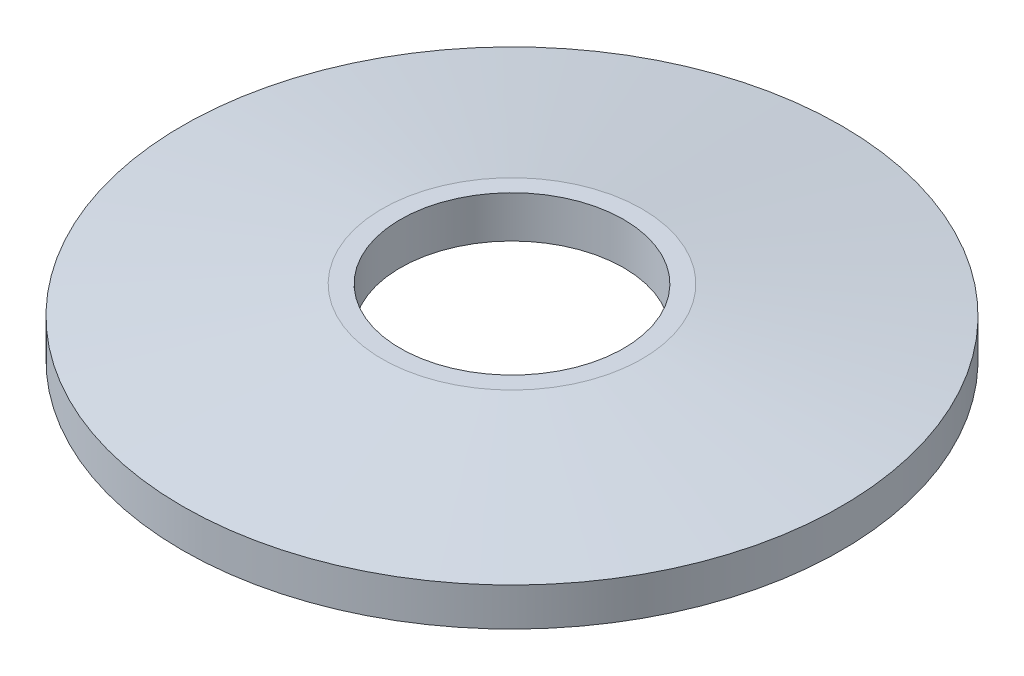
ISO-10303-21;
HEADER;
FILE_DESCRIPTION(('STEP AP214'),'2;1');
FILE_NAME('part.step','',(''),(''),'','','');
FILE_SCHEMA(('AUTOMOTIVE_DESIGN { 1 0 10303 214 1 1 1 1 }'));
ENDSEC;
DATA;
#1=APPLICATION_CONTEXT('core data for automotive mechanical design processes');
#2=APPLICATION_PROTOCOL_DEFINITION('international standard','automotive_design',2000,#1);
#3=PRODUCT_CONTEXT('',#1,'mechanical');
#4=PRODUCT('Part','Part','',(#3));
#5=PRODUCT_RELATED_PRODUCT_CATEGORY('part','',(#4));
#6=PRODUCT_DEFINITION_FORMATION('','',#4);
#7=PRODUCT_DEFINITION_CONTEXT('part definition',#1,'design');
#8=PRODUCT_DEFINITION('design','',#6,#7);
#9=PRODUCT_DEFINITION_SHAPE('','',#8);
#10=(LENGTH_UNIT() NAMED_UNIT(*) SI_UNIT(.MILLI.,.METRE.));
#11=(NAMED_UNIT(*) PLANE_ANGLE_UNIT() SI_UNIT($,.RADIAN.));
#12=(NAMED_UNIT(*) SI_UNIT($,.STERADIAN.) SOLID_ANGLE_UNIT());
#13=UNCERTAINTY_MEASURE_WITH_UNIT(LENGTH_MEASURE(1.E-05),#10,'distance_accuracy_value','');
#14=(GEOMETRIC_REPRESENTATION_CONTEXT(3) GLOBAL_UNCERTAINTY_ASSIGNED_CONTEXT((#13)) GLOBAL_UNIT_ASSIGNED_CONTEXT((#10,
#11,#12)) REPRESENTATION_CONTEXT('',''));
#15=CARTESIAN_POINT('',(0.,0.,0.));
#16=DIRECTION('',(0.,0.,1.));
#17=DIRECTION('',(1.,0.,0.));
#18=AXIS2_PLACEMENT_3D('',#15,#16,#17);
#19=CARTESIAN_POINT('',(7.78188739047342,-1.7999999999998,0.));
#20=DIRECTION('',(0.,-1.,0.));
#21=DIRECTION('',(0.,0.,-1.));
#22=AXIS2_PLACEMENT_3D('',#19,#20,#21);
#23=PLANE('',#22);
#24=CARTESIAN_POINT('',(0.,-1.7999999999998,0.));
#25=DIRECTION('',(0.,-1.,0.));
#26=DIRECTION('',(0.,0.,-1.));
#27=AXIS2_PLACEMENT_3D('',#24,#25,#26);
#28=CIRCLE('',#27,9.);
#29=CARTESIAN_POINT('',(0.,-1.7999999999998,-9.));
#30=VERTEX_POINT('',#29);
#31=EDGE_CURVE('E50',#30,#30,#28,.T.);
#32=ORIENTED_EDGE('',*,*,#31,.T.);
#33=EDGE_LOOP('',(#32));
#34=FACE_BOUND('',#33,.T.);
#35=CARTESIAN_POINT('',(0.,-1.7999999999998,0.));
#36=DIRECTION('',(0.,-1.,0.));
#37=DIRECTION('',(0.,0.,-1.));
#38=AXIS2_PLACEMENT_3D('',#35,#36,#37);
#39=CIRCLE('',#38,7.7818873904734);
#40=CARTESIAN_POINT('',(0.,-1.7999999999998,-7.78188739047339));
#41=VERTEX_POINT('',#40);
#42=EDGE_CURVE('E10',#41,#41,#39,.T.);
#43=ORIENTED_EDGE('',*,*,#42,.F.);
#44=EDGE_LOOP('',(#43));
#45=FACE_BOUND('',#44,.T.);
#46=ADVANCED_FACE('F28',(#34,#45),#23,.T.);
#47=CARTESIAN_POINT('',(0.,-1.7999999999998,0.));
#48=DIRECTION('',(0.,-1.,0.));
#49=DIRECTION('',(0.,0.,-1.));
#50=AXIS2_PLACEMENT_3D('',#47,#48,#49);
#51=CONICAL_SURFACE('',#50,7.7818873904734,1.43260464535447);
#52=CARTESIAN_POINT('',(0.,-1.14189793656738,0.));
#53=DIRECTION('',(0.,-1.,0.));
#54=DIRECTION('',(0.,0.,-1.));
#55=AXIS2_PLACEMENT_3D('',#52,#53,#54);
#56=CIRCLE('',#55,3.05);
#57=CARTESIAN_POINT('',(0.,-1.14189793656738,-3.05));
#58=VERTEX_POINT('',#57);
#59=EDGE_CURVE('E34',#58,#58,#56,.T.);
#60=ORIENTED_EDGE('',*,*,#59,.F.);
#61=EDGE_LOOP('',(#60));
#62=FACE_BOUND('',#61,.T.);
#63=ORIENTED_EDGE('',*,*,#42,.T.);
#64=EDGE_LOOP('',(#63));
#65=FACE_BOUND('',#64,.T.);
#66=ADVANCED_FACE('F76',(#62,#65),#51,.F.);
#67=CARTESIAN_POINT('',(0.,0.,0.));
#68=DIRECTION('',(0.,-1.,0.));
#69=DIRECTION('',(0.,0.,-1.));
#70=AXIS2_PLACEMENT_3D('',#67,#68,#69);
#71=CYLINDRICAL_SURFACE('',#70,3.05);
#72=ORIENTED_EDGE('',*,*,#59,.T.);
#73=EDGE_LOOP('',(#72));
#74=FACE_BOUND('',#73,.T.);
#75=CARTESIAN_POINT('',(0.,0.,0.));
#76=DIRECTION('',(0.,-1.,0.));
#77=DIRECTION('',(0.,0.,-1.));
#78=AXIS2_PLACEMENT_3D('',#75,#76,#77);
#79=CIRCLE('',#78,3.05);
#80=CARTESIAN_POINT('',(0.,0.,-3.05));
#81=VERTEX_POINT('',#80);
#82=EDGE_CURVE('E38',#81,#81,#79,.T.);
#83=ORIENTED_EDGE('',*,*,#82,.F.);
#84=EDGE_LOOP('',(#83));
#85=FACE_BOUND('',#84,.T.);
#86=ADVANCED_FACE('F71',(#74,#85),#71,.F.);
#87=CARTESIAN_POINT('',(3.04999999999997,0.,0.));
#88=DIRECTION('',(0.,-1.,0.));
#89=DIRECTION('',(0.,0.,-1.));
#90=AXIS2_PLACEMENT_3D('',#87,#88,#89);
#91=PLANE('',#90);
#92=CARTESIAN_POINT('',(0.,0.,0.));
#93=DIRECTION('',(0.,-1.,0.));
#94=DIRECTION('',(0.,0.,-1.));
#95=AXIS2_PLACEMENT_3D('',#92,#93,#94);
#96=CIRCLE('',#95,3.55081284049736);
#97=CARTESIAN_POINT('',(0.,0.,-3.55081284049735));
#98=VERTEX_POINT('',#97);
#99=EDGE_CURVE('E42',#98,#98,#96,.T.);
#100=ORIENTED_EDGE('',*,*,#99,.F.);
#101=EDGE_LOOP('',(#100));
#102=FACE_BOUND('',#101,.T.);
#103=ORIENTED_EDGE('',*,*,#82,.T.);
#104=EDGE_LOOP('',(#103));
#105=FACE_BOUND('',#104,.T.);
#106=ADVANCED_FACE('F65',(#102,#105),#91,.F.);
#107=CARTESIAN_POINT('',(0.,0.,0.));
#108=DIRECTION('',(0.,-1.,0.));
#109=DIRECTION('',(0.,0.,-1.));
#110=AXIS2_PLACEMENT_3D('',#107,#108,#109);
#111=CONICAL_SURFACE('',#110,3.55081284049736,1.43260464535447);
#112=CARTESIAN_POINT('',(0.,-0.757862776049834,0.));
#113=DIRECTION('',(0.,-1.,0.));
#114=DIRECTION('',(0.,0.,-1.));
#115=AXIS2_PLACEMENT_3D('',#112,#113,#114);
#116=CIRCLE('',#115,9.);
#117=CARTESIAN_POINT('',(0.,-0.757862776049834,-9.));
#118=VERTEX_POINT('',#117);
#119=EDGE_CURVE('E47',#118,#118,#116,.T.);
#120=ORIENTED_EDGE('',*,*,#119,.F.);
#121=EDGE_LOOP('',(#120));
#122=FACE_BOUND('',#121,.T.);
#123=ORIENTED_EDGE('',*,*,#99,.T.);
#124=EDGE_LOOP('',(#123));
#125=FACE_BOUND('',#124,.T.);
#126=ADVANCED_FACE('F59',(#122,#125),#111,.T.);
#127=CARTESIAN_POINT('',(0.,0.,0.));
#128=DIRECTION('',(0.,-1.,0.));
#129=DIRECTION('',(0.,0.,-1.));
#130=AXIS2_PLACEMENT_3D('',#127,#128,#129);
#131=CYLINDRICAL_SURFACE('',#130,9.);
#132=ORIENTED_EDGE('',*,*,#31,.F.);
#133=EDGE_LOOP('',(#132));
#134=FACE_BOUND('',#133,.T.);
#135=ORIENTED_EDGE('',*,*,#119,.T.);
#136=EDGE_LOOP('',(#135));
#137=FACE_BOUND('',#136,.T.);
#138=ADVANCED_FACE('F56',(#134,#137),#131,.T.);
#139=CLOSED_SHELL('',(#46,#66,#86,#106,#126,#138));
#140=MANIFOLD_SOLID_BREP('B2',#139);
#141=ADVANCED_BREP_SHAPE_REPRESENTATION('',(#18,#140),#14);
#142=SHAPE_DEFINITION_REPRESENTATION(#9,#141);
ENDSEC;
END-ISO-10303-21;
